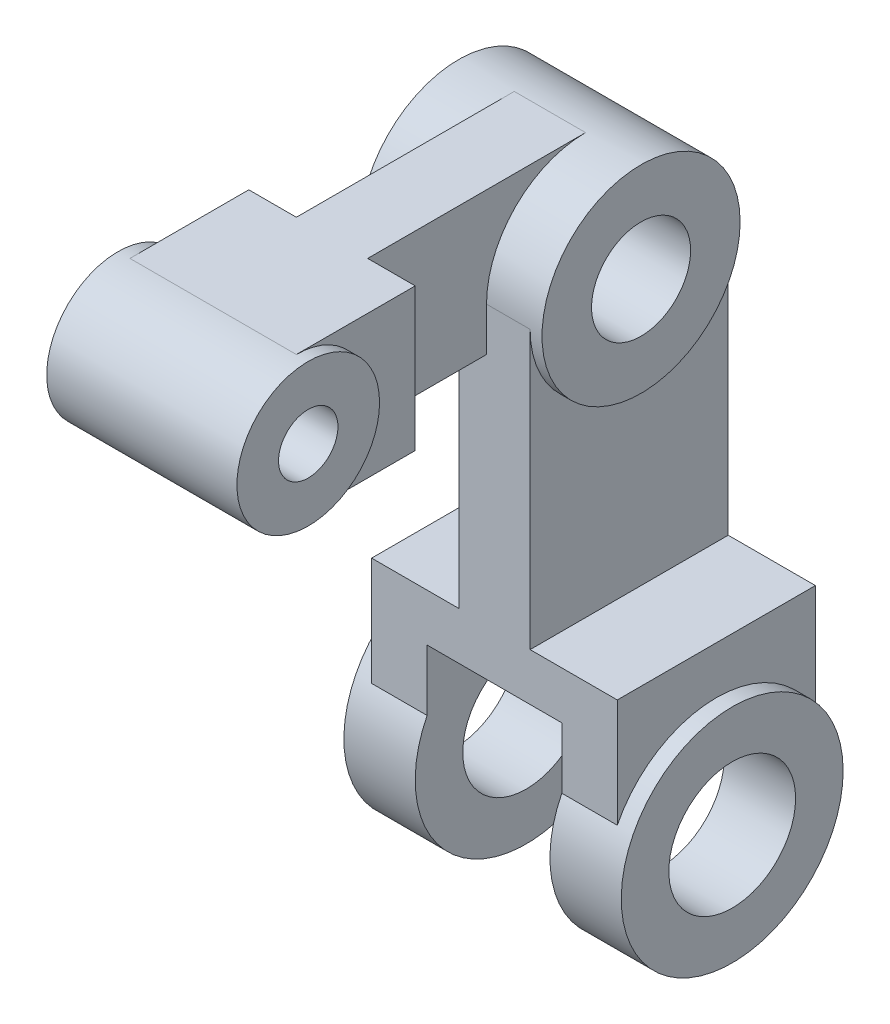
ISO-10303-21;
HEADER;
FILE_DESCRIPTION(('STEP AP214'),'2;1');
FILE_NAME('part.step','',(''),(''),'','','');
FILE_SCHEMA(('AUTOMOTIVE_DESIGN { 1 0 10303 214 1 1 1 1 }'));
ENDSEC;
DATA;
#1=APPLICATION_CONTEXT('core data for automotive mechanical design processes');
#2=APPLICATION_PROTOCOL_DEFINITION('international standard','automotive_design',2000,#1);
#3=PRODUCT_CONTEXT('',#1,'mechanical');
#4=PRODUCT('Part','Part','',(#3));
#5=PRODUCT_RELATED_PRODUCT_CATEGORY('part','',(#4));
#6=PRODUCT_DEFINITION_FORMATION('','',#4);
#7=PRODUCT_DEFINITION_CONTEXT('part definition',#1,'design');
#8=PRODUCT_DEFINITION('design','',#6,#7);
#9=PRODUCT_DEFINITION_SHAPE('','',#8);
#10=(LENGTH_UNIT() NAMED_UNIT(*) SI_UNIT(.MILLI.,.METRE.));
#11=(NAMED_UNIT(*) PLANE_ANGLE_UNIT() SI_UNIT($,.RADIAN.));
#12=(NAMED_UNIT(*) SI_UNIT($,.STERADIAN.) SOLID_ANGLE_UNIT());
#13=UNCERTAINTY_MEASURE_WITH_UNIT(LENGTH_MEASURE(1.E-05),#10,'distance_accuracy_value','');
#14=(GEOMETRIC_REPRESENTATION_CONTEXT(3) GLOBAL_UNCERTAINTY_ASSIGNED_CONTEXT((#13)) GLOBAL_UNIT_ASSIGNED_CONTEXT((#10,
#11,#12)) REPRESENTATION_CONTEXT('',''));
#15=CARTESIAN_POINT('',(0.,0.,0.));
#16=DIRECTION('',(0.,0.,1.));
#17=DIRECTION('',(1.,0.,0.));
#18=AXIS2_PLACEMENT_3D('',#15,#16,#17);
#19=CARTESIAN_POINT('',(35.,0.,0.));
#20=DIRECTION('',(-1.,0.,0.));
#21=DIRECTION('',(0.,0.,1.));
#22=AXIS2_PLACEMENT_3D('',#19,#20,#21);
#23=CYLINDRICAL_SURFACE('',#22,28.);
#24=CARTESIAN_POINT('',(35.,0.,0.));
#25=DIRECTION('',(1.,0.,0.));
#26=DIRECTION('',(0.,0.,-1.));
#27=AXIS2_PLACEMENT_3D('',#24,#25,#26);
#28=CIRCLE('',#27,28.);
#29=CARTESIAN_POINT('',(35.,0.,-28.));
#30=VERTEX_POINT('',#29);
#31=EDGE_CURVE('E386',#30,#30,#28,.T.);
#32=ORIENTED_EDGE('',*,*,#31,.F.);
#33=EDGE_LOOP('',(#32));
#34=FACE_BOUND('',#33,.T.);
#35=DIRECTION('',(-1.,0.,0.));
#36=VECTOR('',#35,1.);
#37=CARTESIAN_POINT('',(31.,12.6095202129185,25.));
#38=LINE('',#37,#36);
#39=CARTESIAN_POINT('',(31.,12.6095202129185,25.));
#40=VERTEX_POINT('',#39);
#41=CARTESIAN_POINT('',(17.,12.6095202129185,25.));
#42=VERTEX_POINT('',#41);
#43=EDGE_CURVE('E394',#40,#42,#38,.T.);
#44=ORIENTED_EDGE('',*,*,#43,.T.);
#45=CARTESIAN_POINT('',(17.,0.,0.));
#46=DIRECTION('',(1.,0.,0.));
#47=DIRECTION('',(0.,1.,0.));
#48=AXIS2_PLACEMENT_3D('',#45,#46,#47);
#49=CIRCLE('',#48,28.);
#50=CARTESIAN_POINT('',(17.,12.6095202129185,-25.));
#51=VERTEX_POINT('',#50);
#52=EDGE_CURVE('E281',#42,#51,#49,.T.);
#53=ORIENTED_EDGE('',*,*,#52,.T.);
#54=DIRECTION('',(-1.,0.,0.));
#55=VECTOR('',#54,1.);
#56=CARTESIAN_POINT('',(31.,12.6095202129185,-25.));
#57=LINE('',#56,#55);
#58=CARTESIAN_POINT('',(31.,12.6095202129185,-25.));
#59=VERTEX_POINT('',#58);
#60=EDGE_CURVE('E399',#59,#51,#57,.T.);
#61=ORIENTED_EDGE('',*,*,#60,.F.);
#62=CARTESIAN_POINT('',(31.,0.,0.));
#63=DIRECTION('',(-1.,0.,0.));
#64=DIRECTION('',(0.,0.,-1.));
#65=AXIS2_PLACEMENT_3D('',#62,#63,#64);
#66=CIRCLE('',#65,28.);
#67=EDGE_CURVE('E355',#40,#59,#66,.T.);
#68=ORIENTED_EDGE('',*,*,#67,.F.);
#69=EDGE_LOOP('',(#44,#53,#61,#68));
#70=FACE_BOUND('',#69,.T.);
#71=ADVANCED_FACE('F39',(#34,#70),#23,.T.);
#72=CARTESIAN_POINT('',(35.,0.,0.));
#73=DIRECTION('',(-1.,0.,0.));
#74=DIRECTION('',(0.,0.,1.));
#75=AXIS2_PLACEMENT_3D('',#72,#73,#74);
#76=CYLINDRICAL_SURFACE('',#75,16.);
#77=CARTESIAN_POINT('',(-17.,0.,0.));
#78=DIRECTION('',(-1.,0.,0.));
#79=DIRECTION('',(0.,-1.,0.));
#80=AXIS2_PLACEMENT_3D('',#77,#78,#79);
#81=CIRCLE('',#80,16.);
#82=CARTESIAN_POINT('',(-17.,-16.,0.));
#83=VERTEX_POINT('',#82);
#84=EDGE_CURVE('E300',#83,#83,#81,.T.);
#85=ORIENTED_EDGE('',*,*,#84,.F.);
#86=EDGE_LOOP('',(#85));
#87=FACE_BOUND('',#86,.T.);
#88=CARTESIAN_POINT('',(-35.,0.,0.));
#89=DIRECTION('',(1.,0.,0.));
#90=DIRECTION('',(0.,0.,-1.));
#91=AXIS2_PLACEMENT_3D('',#88,#89,#90);
#92=CIRCLE('',#91,16.);
#93=CARTESIAN_POINT('',(-35.,0.,-16.));
#94=VERTEX_POINT('',#93);
#95=EDGE_CURVE('E391',#94,#94,#92,.T.);
#96=ORIENTED_EDGE('',*,*,#95,.F.);
#97=EDGE_LOOP('',(#96));
#98=FACE_BOUND('',#97,.T.);
#99=ADVANCED_FACE('F489',(#87,#98),#76,.F.);
#100=CARTESIAN_POINT('',(31.,40.,25.));
#101=DIRECTION('',(0.,-1.,0.));
#102=DIRECTION('',(0.,0.,-1.));
#103=AXIS2_PLACEMENT_3D('',#100,#101,#102);
#104=PLANE('',#103);
#105=DIRECTION('',(0.,0.,-1.));
#106=VECTOR('',#105,1.);
#107=CARTESIAN_POINT('',(9.,40.,0.));
#108=LINE('',#107,#106);
#109=CARTESIAN_POINT('',(9.,40.,25.));
#110=VERTEX_POINT('',#109);
#111=CARTESIAN_POINT('',(9.,40.,-25.));
#112=VERTEX_POINT('',#111);
#113=EDGE_CURVE('E324',#110,#112,#108,.T.);
#114=ORIENTED_EDGE('',*,*,#113,.F.);
#115=DIRECTION('',(-1.,0.,0.));
#116=VECTOR('',#115,1.);
#117=CARTESIAN_POINT('',(31.,40.,25.));
#118=LINE('',#117,#116);
#119=CARTESIAN_POINT('',(31.,40.,25.));
#120=VERTEX_POINT('',#119);
#121=EDGE_CURVE('E380',#120,#110,#118,.T.);
#122=ORIENTED_EDGE('',*,*,#121,.F.);
#123=DIRECTION('',(0.,0.,1.));
#124=VECTOR('',#123,1.);
#125=CARTESIAN_POINT('',(31.,40.,25.));
#126=LINE('',#125,#124);
#127=CARTESIAN_POINT('',(31.,40.,-25.));
#128=VERTEX_POINT('',#127);
#129=EDGE_CURVE('E361',#128,#120,#126,.T.);
#130=ORIENTED_EDGE('',*,*,#129,.F.);
#131=DIRECTION('',(-1.,0.,0.));
#132=VECTOR('',#131,1.);
#133=CARTESIAN_POINT('',(31.,40.,-25.));
#134=LINE('',#133,#132);
#135=EDGE_CURVE('E405',#128,#112,#134,.T.);
#136=ORIENTED_EDGE('',*,*,#135,.T.);
#137=EDGE_LOOP('',(#114,#122,#130,#136));
#138=FACE_BOUND('',#137,.T.);
#139=ADVANCED_FACE('F462',(#138),#104,.F.);
#140=CARTESIAN_POINT('',(35.,0.,0.));
#141=DIRECTION('',(1.,0.,0.));
#142=DIRECTION('',(0.,0.,-1.));
#143=AXIS2_PLACEMENT_3D('',#140,#141,#142);
#144=PLANE('',#143);
#145=ORIENTED_EDGE('',*,*,#31,.T.);
#146=EDGE_LOOP('',(#145));
#147=FACE_BOUND('',#146,.T.);
#148=CARTESIAN_POINT('',(35.,0.,0.));
#149=DIRECTION('',(1.,0.,0.));
#150=DIRECTION('',(0.,0.,-1.));
#151=AXIS2_PLACEMENT_3D('',#148,#149,#150);
#152=CIRCLE('',#151,16.);
#153=CARTESIAN_POINT('',(35.,0.,-16.));
#154=VERTEX_POINT('',#153);
#155=EDGE_CURVE('E387',#154,#154,#152,.T.);
#156=ORIENTED_EDGE('',*,*,#155,.F.);
#157=EDGE_LOOP('',(#156));
#158=FACE_BOUND('',#157,.T.);
#159=ADVANCED_FACE('F486',(#147,#158),#144,.T.);
#160=CARTESIAN_POINT('',(-35.,0.,0.));
#161=DIRECTION('',(1.,0.,0.));
#162=DIRECTION('',(0.,0.,-1.));
#163=AXIS2_PLACEMENT_3D('',#160,#161,#162);
#164=PLANE('',#163);
#165=CARTESIAN_POINT('',(-35.,0.,0.));
#166=DIRECTION('',(1.,0.,0.));
#167=DIRECTION('',(0.,0.,-1.));
#168=AXIS2_PLACEMENT_3D('',#165,#166,#167);
#169=CIRCLE('',#168,28.);
#170=CARTESIAN_POINT('',(-35.,0.,-28.));
#171=VERTEX_POINT('',#170);
#172=EDGE_CURVE('E383',#171,#171,#169,.T.);
#173=ORIENTED_EDGE('',*,*,#172,.F.);
#174=EDGE_LOOP('',(#173));
#175=FACE_BOUND('',#174,.T.);
#176=ORIENTED_EDGE('',*,*,#95,.T.);
#177=EDGE_LOOP('',(#176));
#178=FACE_BOUND('',#177,.T.);
#179=ADVANCED_FACE('F481',(#175,#178),#164,.F.);
#180=CARTESIAN_POINT('',(-17.,12.6095202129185,-25.));
#181=VERTEX_POINT('',#180);
#182=CARTESIAN_POINT('',(-31.,12.6095202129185,-25.));
#183=VERTEX_POINT('',#182);
#184=EDGE_CURVE('E401',#181,#183,#57,.T.);
#185=ORIENTED_EDGE('',*,*,#184,.F.);
#186=CARTESIAN_POINT('',(-17.,0.,0.));
#187=DIRECTION('',(-1.,0.,0.));
#188=DIRECTION('',(0.,-1.,0.));
#189=AXIS2_PLACEMENT_3D('',#186,#187,#188);
#190=CIRCLE('',#189,28.);
#191=CARTESIAN_POINT('',(-17.,12.6095202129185,25.));
#192=VERTEX_POINT('',#191);
#193=EDGE_CURVE('E294',#181,#192,#190,.T.);
#194=ORIENTED_EDGE('',*,*,#193,.T.);
#195=CARTESIAN_POINT('',(-31.,12.6095202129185,25.));
#196=VERTEX_POINT('',#195);
#197=EDGE_CURVE('E398',#192,#196,#38,.T.);
#198=ORIENTED_EDGE('',*,*,#197,.T.);
#199=CARTESIAN_POINT('',(-31.,0.,0.));
#200=DIRECTION('',(-1.,0.,0.));
#201=DIRECTION('',(0.,0.,-1.));
#202=AXIS2_PLACEMENT_3D('',#199,#200,#201);
#203=CIRCLE('',#202,28.);
#204=EDGE_CURVE('E366',#196,#183,#203,.T.);
#205=ORIENTED_EDGE('',*,*,#204,.T.);
#206=EDGE_LOOP('',(#185,#194,#198,#205));
#207=FACE_BOUND('',#206,.T.);
#208=ORIENTED_EDGE('',*,*,#172,.T.);
#209=EDGE_LOOP('',(#208));
#210=FACE_BOUND('',#209,.T.);
#211=ADVANCED_FACE('F41',(#207,#210),#23,.T.);
#212=CARTESIAN_POINT('',(17.,0.,0.));
#213=DIRECTION('',(1.,0.,0.));
#214=DIRECTION('',(0.,1.,0.));
#215=AXIS2_PLACEMENT_3D('',#212,#213,#214);
#216=CIRCLE('',#215,16.);
#217=CARTESIAN_POINT('',(17.,16.,0.));
#218=VERTEX_POINT('',#217);
#219=EDGE_CURVE('E288',#218,#218,#216,.T.);
#220=ORIENTED_EDGE('',*,*,#219,.F.);
#221=EDGE_LOOP('',(#220));
#222=FACE_BOUND('',#221,.T.);
#223=ORIENTED_EDGE('',*,*,#155,.T.);
#224=EDGE_LOOP('',(#223));
#225=FACE_BOUND('',#224,.T.);
#226=ADVANCED_FACE('F480',(#222,#225),#76,.F.);
#227=CARTESIAN_POINT('',(31.,40.,25.));
#228=DIRECTION('',(0.,0.,-1.));
#229=DIRECTION('',(0.,1.,0.));
#230=AXIS2_PLACEMENT_3D('',#227,#228,#229);
#231=PLANE('',#230);
#232=DIRECTION('',(0.,1.,0.));
#233=VECTOR('',#232,1.);
#234=CARTESIAN_POINT('',(-2.,134.99999999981,24.9999999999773));
#235=LINE('',#234,#233);
#236=CARTESIAN_POINT('',(-2.,99.,25.));
#237=VERTEX_POINT('',#236);
#238=CARTESIAN_POINT('',(-2.,110.,25.));
#239=VERTEX_POINT('',#238);
#240=EDGE_CURVE('E56',#237,#239,#235,.T.);
#241=ORIENTED_EDGE('',*,*,#240,.F.);
#242=DIRECTION('',(1.,0.,0.));
#243=VECTOR('',#242,1.);
#244=CARTESIAN_POINT('',(-20.,99.,24.9999999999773));
#245=LINE('',#244,#243);
#246=CARTESIAN_POINT('',(-9.,99.,25.));
#247=VERTEX_POINT('',#246);
#248=EDGE_CURVE('E60',#247,#237,#245,.T.);
#249=ORIENTED_EDGE('',*,*,#248,.F.);
#250=DIRECTION('',(0.,1.,0.));
#251=VECTOR('',#250,1.);
#252=CARTESIAN_POINT('',(-9.,0.,25.));
#253=LINE('',#252,#251);
#254=CARTESIAN_POINT('',(-9.,40.,25.));
#255=VERTEX_POINT('',#254);
#256=EDGE_CURVE('E343',#255,#247,#253,.T.);
#257=ORIENTED_EDGE('',*,*,#256,.F.);
#258=CARTESIAN_POINT('',(-31.,40.,25.));
#259=VERTEX_POINT('',#258);
#260=EDGE_CURVE('E363',#255,#259,#118,.T.);
#261=ORIENTED_EDGE('',*,*,#260,.T.);
#262=DIRECTION('',(0.,-1.,0.));
#263=VECTOR('',#262,1.);
#264=CARTESIAN_POINT('',(-31.,40.,25.));
#265=LINE('',#264,#263);
#266=EDGE_CURVE('E351',#259,#196,#265,.T.);
#267=ORIENTED_EDGE('',*,*,#266,.T.);
#268=ORIENTED_EDGE('',*,*,#197,.F.);
#269=DIRECTION('',(0.,1.,0.));
#270=VECTOR('',#269,1.);
#271=CARTESIAN_POINT('',(-17.,40.,25.));
#272=LINE('',#271,#270);
#273=CARTESIAN_POINT('',(-17.,28.,25.));
#274=VERTEX_POINT('',#273);
#275=EDGE_CURVE('E297',#192,#274,#272,.T.);
#276=ORIENTED_EDGE('',*,*,#275,.T.);
#277=DIRECTION('',(1.,0.,0.));
#278=VECTOR('',#277,1.);
#279=CARTESIAN_POINT('',(31.,28.,25.));
#280=LINE('',#279,#278);
#281=CARTESIAN_POINT('',(17.,28.,25.));
#282=VERTEX_POINT('',#281);
#283=EDGE_CURVE('E291',#274,#282,#280,.T.);
#284=ORIENTED_EDGE('',*,*,#283,.T.);
#285=DIRECTION('',(0.,-1.,0.));
#286=VECTOR('',#285,1.);
#287=CARTESIAN_POINT('',(17.,40.,25.));
#288=LINE('',#287,#286);
#289=EDGE_CURVE('E285',#282,#42,#288,.T.);
#290=ORIENTED_EDGE('',*,*,#289,.T.);
#291=ORIENTED_EDGE('',*,*,#43,.F.);
#292=DIRECTION('',(0.,-1.,0.));
#293=VECTOR('',#292,1.);
#294=CARTESIAN_POINT('',(31.,40.,25.));
#295=LINE('',#294,#293);
#296=EDGE_CURVE('E352',#120,#40,#295,.T.);
#297=ORIENTED_EDGE('',*,*,#296,.F.);
#298=ORIENTED_EDGE('',*,*,#121,.T.);
#299=DIRECTION('',(0.,1.,0.));
#300=VECTOR('',#299,1.);
#301=CARTESIAN_POINT('',(9.,0.,25.));
#302=LINE('',#301,#300);
#303=CARTESIAN_POINT('',(9.,110.,25.));
#304=VERTEX_POINT('',#303);
#305=EDGE_CURVE('E318',#110,#304,#302,.T.);
#306=ORIENTED_EDGE('',*,*,#305,.T.);
#307=DIRECTION('',(-1.,0.,0.));
#308=VECTOR('',#307,1.);
#309=CARTESIAN_POINT('',(9.,110.,25.));
#310=LINE('',#309,#308);
#311=EDGE_CURVE('E349',#304,#239,#310,.T.);
#312=ORIENTED_EDGE('',*,*,#311,.T.);
#313=EDGE_LOOP('',(#241,#249,#257,#261,#267,#268,#276,#284,#290,#291,#297,#298,#306,#312));
#314=FACE_BOUND('',#313,.T.);
#315=ADVANCED_FACE('F425',(#314),#231,.F.);
#316=CARTESIAN_POINT('',(31.,40.,-25.));
#317=DIRECTION('',(0.,0.,1.));
#318=DIRECTION('',(0.,-1.,0.));
#319=AXIS2_PLACEMENT_3D('',#316,#317,#318);
#320=PLANE('',#319);
#321=DIRECTION('',(-1.,0.,0.));
#322=VECTOR('',#321,1.);
#323=CARTESIAN_POINT('',(31.,28.,-25.));
#324=LINE('',#323,#322);
#325=CARTESIAN_POINT('',(17.,28.,-25.));
#326=VERTEX_POINT('',#325);
#327=CARTESIAN_POINT('',(-17.,28.,-25.));
#328=VERTEX_POINT('',#327);
#329=EDGE_CURVE('E48',#326,#328,#324,.T.);
#330=ORIENTED_EDGE('',*,*,#329,.T.);
#331=DIRECTION('',(0.,-1.,0.));
#332=VECTOR('',#331,1.);
#333=CARTESIAN_POINT('',(-17.,40.,-25.));
#334=LINE('',#333,#332);
#335=EDGE_CURVE('E11',#328,#181,#334,.T.);
#336=ORIENTED_EDGE('',*,*,#335,.T.);
#337=ORIENTED_EDGE('',*,*,#184,.T.);
#338=DIRECTION('',(0.,1.,0.));
#339=VECTOR('',#338,1.);
#340=CARTESIAN_POINT('',(-31.,40.,-25.));
#341=LINE('',#340,#339);
#342=CARTESIAN_POINT('',(-31.,40.,-25.));
#343=VERTEX_POINT('',#342);
#344=EDGE_CURVE('E369',#183,#343,#341,.T.);
#345=ORIENTED_EDGE('',*,*,#344,.T.);
#346=CARTESIAN_POINT('',(-9.,40.,-25.));
#347=VERTEX_POINT('',#346);
#348=EDGE_CURVE('E329',#347,#343,#134,.T.);
#349=ORIENTED_EDGE('',*,*,#348,.F.);
#350=DIRECTION('',(0.,1.,0.));
#351=VECTOR('',#350,1.);
#352=CARTESIAN_POINT('',(-9.,0.,-25.));
#353=LINE('',#352,#351);
#354=CARTESIAN_POINT('',(-9.,110.,-25.));
#355=VERTEX_POINT('',#354);
#356=EDGE_CURVE('E319',#347,#355,#353,.T.);
#357=ORIENTED_EDGE('',*,*,#356,.T.);
#358=DIRECTION('',(-1.,0.,0.));
#359=VECTOR('',#358,1.);
#360=CARTESIAN_POINT('',(9.,110.,-25.));
#361=LINE('',#360,#359);
#362=CARTESIAN_POINT('',(9.,110.,-25.));
#363=VERTEX_POINT('',#362);
#364=EDGE_CURVE('E334',#363,#355,#361,.T.);
#365=ORIENTED_EDGE('',*,*,#364,.F.);
#366=DIRECTION('',(0.,1.,0.));
#367=VECTOR('',#366,1.);
#368=CARTESIAN_POINT('',(9.,0.,-25.));
#369=LINE('',#368,#367);
#370=EDGE_CURVE('E328',#112,#363,#369,.T.);
#371=ORIENTED_EDGE('',*,*,#370,.F.);
#372=ORIENTED_EDGE('',*,*,#135,.F.);
#373=DIRECTION('',(0.,1.,0.));
#374=VECTOR('',#373,1.);
#375=CARTESIAN_POINT('',(31.,40.,-25.));
#376=LINE('',#375,#374);
#377=EDGE_CURVE('E359',#59,#128,#376,.T.);
#378=ORIENTED_EDGE('',*,*,#377,.F.);
#379=ORIENTED_EDGE('',*,*,#60,.T.);
#380=DIRECTION('',(0.,1.,0.));
#381=VECTOR('',#380,1.);
#382=CARTESIAN_POINT('',(17.,40.,-25.));
#383=LINE('',#382,#381);
#384=EDGE_CURVE('E390',#51,#326,#383,.T.);
#385=ORIENTED_EDGE('',*,*,#384,.T.);
#386=EDGE_LOOP('',(#330,#336,#337,#345,#349,#357,#365,#371,#372,#378,#379,#385));
#387=FACE_BOUND('',#386,.T.);
#388=ADVANCED_FACE('F420',(#387),#320,.F.);
#389=ORIENTED_EDGE('',*,*,#260,.F.);
#390=DIRECTION('',(0.,0.,-1.));
#391=VECTOR('',#390,1.);
#392=CARTESIAN_POINT('',(-9.,40.,0.));
#393=LINE('',#392,#391);
#394=EDGE_CURVE('E341',#255,#347,#393,.T.);
#395=ORIENTED_EDGE('',*,*,#394,.T.);
#396=ORIENTED_EDGE('',*,*,#348,.T.);
#397=DIRECTION('',(0.,0.,1.));
#398=VECTOR('',#397,1.);
#399=CARTESIAN_POINT('',(-31.,40.,25.));
#400=LINE('',#399,#398);
#401=EDGE_CURVE('E356',#343,#259,#400,.T.);
#402=ORIENTED_EDGE('',*,*,#401,.T.);
#403=EDGE_LOOP('',(#389,#395,#396,#402));
#404=FACE_BOUND('',#403,.T.);
#405=ADVANCED_FACE('F412',(#404),#104,.F.);
#406=CARTESIAN_POINT('',(31.,0.,0.));
#407=DIRECTION('',(1.,0.,0.));
#408=DIRECTION('',(0.,0.,-1.));
#409=AXIS2_PLACEMENT_3D('',#406,#407,#408);
#410=PLANE('',#409);
#411=ORIENTED_EDGE('',*,*,#296,.T.);
#412=ORIENTED_EDGE('',*,*,#67,.T.);
#413=ORIENTED_EDGE('',*,*,#377,.T.);
#414=ORIENTED_EDGE('',*,*,#129,.T.);
#415=EDGE_LOOP('',(#411,#412,#413,#414));
#416=FACE_BOUND('',#415,.T.);
#417=ADVANCED_FACE('F466',(#416),#410,.T.);
#418=CARTESIAN_POINT('',(-31.,0.,0.));
#419=DIRECTION('',(1.,0.,0.));
#420=DIRECTION('',(0.,0.,-1.));
#421=AXIS2_PLACEMENT_3D('',#418,#419,#420);
#422=PLANE('',#421);
#423=ORIENTED_EDGE('',*,*,#266,.F.);
#424=ORIENTED_EDGE('',*,*,#401,.F.);
#425=ORIENTED_EDGE('',*,*,#344,.F.);
#426=ORIENTED_EDGE('',*,*,#204,.F.);
#427=EDGE_LOOP('',(#423,#424,#425,#426));
#428=FACE_BOUND('',#427,.T.);
#429=ADVANCED_FACE('F423',(#428),#422,.F.);
#430=CARTESIAN_POINT('',(9.,0.,0.));
#431=DIRECTION('',(1.,0.,0.));
#432=DIRECTION('',(0.,0.,-1.));
#433=AXIS2_PLACEMENT_3D('',#430,#431,#432);
#434=PLANE('',#433);
#435=CARTESIAN_POINT('',(9.,110.,0.));
#436=DIRECTION('',(1.,0.,0.));
#437=DIRECTION('',(0.,0.,-1.));
#438=AXIS2_PLACEMENT_3D('',#435,#436,#437);
#439=CIRCLE('',#438,25.);
#440=EDGE_CURVE('E316',#304,#363,#439,.T.);
#441=ORIENTED_EDGE('',*,*,#440,.F.);
#442=ORIENTED_EDGE('',*,*,#305,.F.);
#443=ORIENTED_EDGE('',*,*,#113,.T.);
#444=ORIENTED_EDGE('',*,*,#370,.T.);
#445=EDGE_LOOP('',(#441,#442,#443,#444));
#446=FACE_BOUND('',#445,.T.);
#447=ADVANCED_FACE('F459',(#446),#434,.T.);
#448=CARTESIAN_POINT('',(-9.,0.,0.));
#449=DIRECTION('',(1.,0.,0.));
#450=DIRECTION('',(0.,0.,-1.));
#451=AXIS2_PLACEMENT_3D('',#448,#449,#450);
#452=PLANE('',#451);
#453=ORIENTED_EDGE('',*,*,#256,.T.);
#454=DIRECTION('',(0.,0.,1.));
#455=VECTOR('',#454,1.);
#456=CARTESIAN_POINT('',(-9.,99.,-500000.));
#457=LINE('',#456,#455);
#458=CARTESIAN_POINT('',(-9.,99.,22.4499443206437));
#459=VERTEX_POINT('',#458);
#460=EDGE_CURVE('E270',#459,#247,#457,.T.);
#461=ORIENTED_EDGE('',*,*,#460,.F.);
#462=CARTESIAN_POINT('',(-9.,110.,0.));
#463=DIRECTION('',(1.,0.,0.));
#464=DIRECTION('',(0.,0.,-1.));
#465=AXIS2_PLACEMENT_3D('',#462,#463,#464);
#466=CIRCLE('',#465,25.);
#467=EDGE_CURVE('E315',#459,#355,#466,.T.);
#468=ORIENTED_EDGE('',*,*,#467,.T.);
#469=ORIENTED_EDGE('',*,*,#356,.F.);
#470=ORIENTED_EDGE('',*,*,#394,.F.);
#471=EDGE_LOOP('',(#453,#461,#468,#469,#470));
#472=FACE_BOUND('',#471,.T.);
#473=ADVANCED_FACE('F427',(#472),#452,.F.);
#474=CARTESIAN_POINT('',(-34.,110.,0.));
#475=DIRECTION('',(1.,0.,0.));
#476=DIRECTION('',(0.,0.,-1.));
#477=AXIS2_PLACEMENT_3D('',#474,#475,#476);
#478=CYLINDRICAL_SURFACE('',#477,12.5);
#479=CARTESIAN_POINT('',(-34.,110.,0.));
#480=DIRECTION('',(1.,0.,0.));
#481=DIRECTION('',(0.,0.,-1.));
#482=AXIS2_PLACEMENT_3D('',#479,#480,#481);
#483=CIRCLE('',#482,12.5);
#484=CARTESIAN_POINT('',(-34.,110.,-12.5));
#485=VERTEX_POINT('',#484);
#486=EDGE_CURVE('E309',#485,#485,#483,.T.);
#487=ORIENTED_EDGE('',*,*,#486,.F.);
#488=EDGE_LOOP('',(#487));
#489=FACE_BOUND('',#488,.T.);
#490=CARTESIAN_POINT('',(12.,110.,0.));
#491=DIRECTION('',(1.,0.,0.));
#492=DIRECTION('',(0.,0.,-1.));
#493=AXIS2_PLACEMENT_3D('',#490,#491,#492);
#494=CIRCLE('',#493,12.5);
#495=CARTESIAN_POINT('',(12.,110.,-12.5));
#496=VERTEX_POINT('',#495);
#497=EDGE_CURVE('E303',#496,#496,#494,.T.);
#498=ORIENTED_EDGE('',*,*,#497,.T.);
#499=EDGE_LOOP('',(#498));
#500=FACE_BOUND('',#499,.T.);
#501=ADVANCED_FACE('F593',(#489,#500),#478,.F.);
#502=CARTESIAN_POINT('',(-34.,110.,0.));
#503=DIRECTION('',(1.,0.,0.));
#504=DIRECTION('',(0.,0.,-1.));
#505=AXIS2_PLACEMENT_3D('',#502,#503,#504);
#506=CYLINDRICAL_SURFACE('',#505,25.);
#507=DIRECTION('',(1.,0.,0.));
#508=VECTOR('',#507,1.);
#509=CARTESIAN_POINT('',(-34.,99.,22.4499443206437));
#510=LINE('',#509,#508);
#511=CARTESIAN_POINT('',(-20.,99.0000000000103,22.4499443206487));
#512=VERTEX_POINT('',#511);
#513=EDGE_CURVE('E250',#459,#512,#510,.F.);
#514=ORIENTED_EDGE('',*,*,#513,.T.);
#515=CARTESIAN_POINT('',(-20.,110.,0.));
#516=DIRECTION('',(-1.,0.,0.));
#517=DIRECTION('',(0.,-1.,0.));
#518=AXIS2_PLACEMENT_3D('',#515,#516,#517);
#519=CIRCLE('',#518,25.);
#520=CARTESIAN_POINT('',(-20.,135.,0.));
#521=VERTEX_POINT('',#520);
#522=EDGE_CURVE('E272',#512,#521,#519,.T.);
#523=ORIENTED_EDGE('',*,*,#522,.T.);
#524=DIRECTION('',(1.,0.,0.));
#525=VECTOR('',#524,1.);
#526=CARTESIAN_POINT('',(-34.,135.,0.));
#527=LINE('',#526,#525);
#528=CARTESIAN_POINT('',(-2.,135.,0.));
#529=VERTEX_POINT('',#528);
#530=EDGE_CURVE('E207',#521,#529,#527,.T.);
#531=ORIENTED_EDGE('',*,*,#530,.T.);
#532=CARTESIAN_POINT('',(-1.99999999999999,110.,0.));
#533=DIRECTION('',(1.,0.,0.));
#534=DIRECTION('',(0.,1.,0.));
#535=AXIS2_PLACEMENT_3D('',#532,#533,#534);
#536=CIRCLE('',#535,25.);
#537=EDGE_CURVE('E275',#529,#239,#536,.T.);
#538=ORIENTED_EDGE('',*,*,#537,.T.);
#539=ORIENTED_EDGE('',*,*,#311,.F.);
#540=ORIENTED_EDGE('',*,*,#440,.T.);
#541=ORIENTED_EDGE('',*,*,#364,.T.);
#542=ORIENTED_EDGE('',*,*,#467,.F.);
#543=EDGE_LOOP('',(#514,#523,#531,#538,#539,#540,#541,#542));
#544=FACE_BOUND('',#543,.T.);
#545=CARTESIAN_POINT('',(-34.,110.,0.));
#546=DIRECTION('',(1.,0.,0.));
#547=DIRECTION('',(0.,0.,-1.));
#548=AXIS2_PLACEMENT_3D('',#545,#546,#547);
#549=CIRCLE('',#548,25.);
#550=CARTESIAN_POINT('',(-34.,110.,-25.));
#551=VERTEX_POINT('',#550);
#552=EDGE_CURVE('E312',#551,#551,#549,.T.);
#553=ORIENTED_EDGE('',*,*,#552,.T.);
#554=EDGE_LOOP('',(#553));
#555=FACE_BOUND('',#554,.T.);
#556=CARTESIAN_POINT('',(12.,110.,0.));
#557=DIRECTION('',(1.,0.,0.));
#558=DIRECTION('',(0.,0.,-1.));
#559=AXIS2_PLACEMENT_3D('',#556,#557,#558);
#560=CIRCLE('',#559,25.);
#561=CARTESIAN_POINT('',(12.,110.,-25.));
#562=VERTEX_POINT('',#561);
#563=EDGE_CURVE('E306',#562,#562,#560,.T.);
#564=ORIENTED_EDGE('',*,*,#563,.F.);
#565=EDGE_LOOP('',(#564));
#566=FACE_BOUND('',#565,.T.);
#567=ADVANCED_FACE('F454',(#544,#555,#566),#506,.T.);
#568=CARTESIAN_POINT('',(-34.,0.,0.));
#569=DIRECTION('',(1.,0.,0.));
#570=DIRECTION('',(0.,0.,-1.));
#571=AXIS2_PLACEMENT_3D('',#568,#569,#570);
#572=PLANE('',#571);
#573=ORIENTED_EDGE('',*,*,#486,.T.);
#574=EDGE_LOOP('',(#573));
#575=FACE_BOUND('',#574,.T.);
#576=ORIENTED_EDGE('',*,*,#552,.F.);
#577=EDGE_LOOP('',(#576));
#578=FACE_BOUND('',#577,.T.);
#579=ADVANCED_FACE('F605',(#575,#578),#572,.F.);
#580=CARTESIAN_POINT('',(12.,0.,0.));
#581=DIRECTION('',(1.,0.,0.));
#582=DIRECTION('',(0.,0.,-1.));
#583=AXIS2_PLACEMENT_3D('',#580,#581,#582);
#584=PLANE('',#583);
#585=ORIENTED_EDGE('',*,*,#497,.F.);
#586=EDGE_LOOP('',(#585));
#587=FACE_BOUND('',#586,.T.);
#588=ORIENTED_EDGE('',*,*,#563,.T.);
#589=EDGE_LOOP('',(#588));
#590=FACE_BOUND('',#589,.T.);
#591=ADVANCED_FACE('F556',(#587,#590),#584,.T.);
#592=CARTESIAN_POINT('',(-17.,28.,-28.));
#593=DIRECTION('',(-1.,0.,0.));
#594=DIRECTION('',(0.,-1.,0.));
#595=AXIS2_PLACEMENT_3D('',#592,#593,#594);
#596=PLANE('',#595);
#597=ORIENTED_EDGE('',*,*,#84,.T.);
#598=EDGE_LOOP('',(#597));
#599=FACE_BOUND('',#598,.T.);
#600=ORIENTED_EDGE('',*,*,#193,.F.);
#601=ORIENTED_EDGE('',*,*,#335,.F.);
#602=DIRECTION('',(0.,0.,1.));
#603=VECTOR('',#602,1.);
#604=CARTESIAN_POINT('',(-17.,28.,-28.));
#605=LINE('',#604,#603);
#606=EDGE_CURVE('E278',#328,#274,#605,.T.);
#607=ORIENTED_EDGE('',*,*,#606,.T.);
#608=ORIENTED_EDGE('',*,*,#275,.F.);
#609=EDGE_LOOP('',(#600,#601,#607,#608));
#610=FACE_BOUND('',#609,.T.);
#611=ADVANCED_FACE('F476',(#599,#610),#596,.F.);
#612=CARTESIAN_POINT('',(-17.,28.,-28.));
#613=DIRECTION('',(0.,1.,0.));
#614=DIRECTION('',(-1.,0.,0.));
#615=AXIS2_PLACEMENT_3D('',#612,#613,#614);
#616=PLANE('',#615);
#617=ORIENTED_EDGE('',*,*,#606,.F.);
#618=ORIENTED_EDGE('',*,*,#329,.F.);
#619=DIRECTION('',(0.,0.,1.));
#620=VECTOR('',#619,1.);
#621=CARTESIAN_POINT('',(17.,28.,-28.));
#622=LINE('',#621,#620);
#623=EDGE_CURVE('E264',#326,#282,#622,.T.);
#624=ORIENTED_EDGE('',*,*,#623,.T.);
#625=ORIENTED_EDGE('',*,*,#283,.F.);
#626=EDGE_LOOP('',(#617,#618,#624,#625));
#627=FACE_BOUND('',#626,.T.);
#628=ADVANCED_FACE('F474',(#627),#616,.F.);
#629=CARTESIAN_POINT('',(17.,28.,-28.));
#630=DIRECTION('',(1.,0.,0.));
#631=DIRECTION('',(0.,1.,0.));
#632=AXIS2_PLACEMENT_3D('',#629,#630,#631);
#633=PLANE('',#632);
#634=ORIENTED_EDGE('',*,*,#219,.T.);
#635=EDGE_LOOP('',(#634));
#636=FACE_BOUND('',#635,.T.);
#637=ORIENTED_EDGE('',*,*,#623,.F.);
#638=ORIENTED_EDGE('',*,*,#384,.F.);
#639=ORIENTED_EDGE('',*,*,#52,.F.);
#640=ORIENTED_EDGE('',*,*,#289,.F.);
#641=EDGE_LOOP('',(#637,#638,#639,#640));
#642=FACE_BOUND('',#641,.T.);
#643=ADVANCED_FACE('F470',(#636,#642),#633,.F.);
#644=CARTESIAN_POINT('',(-20.,99.,-500000.));
#645=DIRECTION('',(0.,-1.,0.));
#646=DIRECTION('',(0.,0.,-1.));
#647=AXIS2_PLACEMENT_3D('',#644,#645,#646);
#648=PLANE('',#647);
#649=ORIENTED_EDGE('',*,*,#513,.F.);
#650=ORIENTED_EDGE('',*,*,#460,.T.);
#651=ORIENTED_EDGE('',*,*,#248,.T.);
#652=DIRECTION('',(0.,0.,1.));
#653=VECTOR('',#652,1.);
#654=CARTESIAN_POINT('',(-2.,99.,-500000.));
#655=LINE('',#654,#653);
#656=CARTESIAN_POINT('',(-2.,99.,55.));
#657=VERTEX_POINT('',#656);
#658=EDGE_CURVE('E253',#237,#657,#655,.T.);
#659=ORIENTED_EDGE('',*,*,#658,.T.);
#660=DIRECTION('',(-1.,0.,0.));
#661=VECTOR('',#660,1.);
#662=CARTESIAN_POINT('',(10.,99.,55.));
#663=LINE('',#662,#661);
#664=CARTESIAN_POINT('',(10.,99.,55.));
#665=VERTEX_POINT('',#664);
#666=EDGE_CURVE('E208',#665,#657,#663,.T.);
#667=ORIENTED_EDGE('',*,*,#666,.F.);
#668=DIRECTION('',(0.,0.,1.));
#669=VECTOR('',#668,1.);
#670=CARTESIAN_POINT('',(10.,99.,0.));
#671=LINE('',#670,#669);
#672=CARTESIAN_POINT('',(10.,99.,85.));
#673=VERTEX_POINT('',#672);
#674=EDGE_CURVE('E206',#665,#673,#671,.T.);
#675=ORIENTED_EDGE('',*,*,#674,.T.);
#676=DIRECTION('',(-1.,0.,0.));
#677=VECTOR('',#676,1.);
#678=CARTESIAN_POINT('',(10.,99.,85.));
#679=LINE('',#678,#677);
#680=CARTESIAN_POINT('',(-32.,99.,85.));
#681=VERTEX_POINT('',#680);
#682=EDGE_CURVE('E187',#673,#681,#679,.T.);
#683=ORIENTED_EDGE('',*,*,#682,.T.);
#684=DIRECTION('',(0.,0.,1.));
#685=VECTOR('',#684,1.);
#686=CARTESIAN_POINT('',(-32.,99.,0.));
#687=LINE('',#686,#685);
#688=CARTESIAN_POINT('',(-32.,99.,55.));
#689=VERTEX_POINT('',#688);
#690=EDGE_CURVE('E195',#689,#681,#687,.T.);
#691=ORIENTED_EDGE('',*,*,#690,.F.);
#692=CARTESIAN_POINT('',(-20.,99.,55.));
#693=VERTEX_POINT('',#692);
#694=EDGE_CURVE('E232',#693,#689,#663,.T.);
#695=ORIENTED_EDGE('',*,*,#694,.F.);
#696=DIRECTION('',(0.,0.,1.));
#697=VECTOR('',#696,1.);
#698=CARTESIAN_POINT('',(-20.,99.,-500000.));
#699=LINE('',#698,#697);
#700=EDGE_CURVE('E248',#512,#693,#699,.T.);
#701=ORIENTED_EDGE('',*,*,#700,.F.);
#702=EDGE_LOOP('',(#649,#650,#651,#659,#667,#675,#683,#691,#695,#701));
#703=FACE_BOUND('',#702,.T.);
#704=ADVANCED_FACE('F202',(#703),#648,.T.);
#705=CARTESIAN_POINT('',(-2.,135.,-500000.));
#706=DIRECTION('',(1.,0.,0.));
#707=DIRECTION('',(0.,1.,0.));
#708=AXIS2_PLACEMENT_3D('',#705,#706,#707);
#709=PLANE('',#708);
#710=ORIENTED_EDGE('',*,*,#537,.F.);
#711=DIRECTION('',(0.,0.,1.));
#712=VECTOR('',#711,1.);
#713=CARTESIAN_POINT('',(-2.,135.,-500000.));
#714=LINE('',#713,#712);
#715=CARTESIAN_POINT('',(-1.99999999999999,135.,55.));
#716=VERTEX_POINT('',#715);
#717=EDGE_CURVE('E255',#529,#716,#714,.T.);
#718=ORIENTED_EDGE('',*,*,#717,.T.);
#719=DIRECTION('',(0.,1.,0.));
#720=VECTOR('',#719,1.);
#721=CARTESIAN_POINT('',(-2.,135.,55.));
#722=LINE('',#721,#720);
#723=EDGE_CURVE('E265',#657,#716,#722,.T.);
#724=ORIENTED_EDGE('',*,*,#723,.F.);
#725=ORIENTED_EDGE('',*,*,#658,.F.);
#726=ORIENTED_EDGE('',*,*,#240,.T.);
#727=EDGE_LOOP('',(#710,#718,#724,#725,#726));
#728=FACE_BOUND('',#727,.T.);
#729=ADVANCED_FACE('F444',(#728),#709,.T.);
#730=CARTESIAN_POINT('',(-20.,135.,-500000.));
#731=DIRECTION('',(-1.,0.,0.));
#732=DIRECTION('',(0.,-1.,0.));
#733=AXIS2_PLACEMENT_3D('',#730,#731,#732);
#734=PLANE('',#733);
#735=ORIENTED_EDGE('',*,*,#522,.F.);
#736=ORIENTED_EDGE('',*,*,#700,.T.);
#737=DIRECTION('',(0.,-1.,0.));
#738=VECTOR('',#737,1.);
#739=CARTESIAN_POINT('',(-20.,135.,55.));
#740=LINE('',#739,#738);
#741=CARTESIAN_POINT('',(-20.,135.,55.));
#742=VERTEX_POINT('',#741);
#743=EDGE_CURVE('E246',#742,#693,#740,.T.);
#744=ORIENTED_EDGE('',*,*,#743,.F.);
#745=DIRECTION('',(0.,0.,1.));
#746=VECTOR('',#745,1.);
#747=CARTESIAN_POINT('',(-20.,135.,-500000.));
#748=LINE('',#747,#746);
#749=EDGE_CURVE('E241',#521,#742,#748,.T.);
#750=ORIENTED_EDGE('',*,*,#749,.F.);
#751=EDGE_LOOP('',(#735,#736,#744,#750));
#752=FACE_BOUND('',#751,.T.);
#753=ADVANCED_FACE('F616',(#752),#734,.T.);
#754=CARTESIAN_POINT('',(-20.,135.,-500000.));
#755=DIRECTION('',(0.,1.,0.));
#756=DIRECTION('',(0.,0.,1.));
#757=AXIS2_PLACEMENT_3D('',#754,#755,#756);
#758=PLANE('',#757);
#759=ORIENTED_EDGE('',*,*,#530,.F.);
#760=ORIENTED_EDGE('',*,*,#749,.T.);
#761=DIRECTION('',(-1.,0.,0.));
#762=VECTOR('',#761,1.);
#763=CARTESIAN_POINT('',(10.,135.,55.));
#764=LINE('',#763,#762);
#765=CARTESIAN_POINT('',(-32.,135.,55.));
#766=VERTEX_POINT('',#765);
#767=EDGE_CURVE('E221',#742,#766,#764,.T.);
#768=ORIENTED_EDGE('',*,*,#767,.T.);
#769=DIRECTION('',(0.,0.,-1.));
#770=VECTOR('',#769,1.);
#771=CARTESIAN_POINT('',(-32.,135.,0.));
#772=LINE('',#771,#770);
#773=CARTESIAN_POINT('',(-32.,135.,85.));
#774=VERTEX_POINT('',#773);
#775=EDGE_CURVE('E214',#774,#766,#772,.T.);
#776=ORIENTED_EDGE('',*,*,#775,.F.);
#777=DIRECTION('',(-1.,0.,0.));
#778=VECTOR('',#777,1.);
#779=CARTESIAN_POINT('',(10.,135.,85.));
#780=LINE('',#779,#778);
#781=CARTESIAN_POINT('',(10.,135.,85.));
#782=VERTEX_POINT('',#781);
#783=EDGE_CURVE('E190',#782,#774,#780,.T.);
#784=ORIENTED_EDGE('',*,*,#783,.F.);
#785=DIRECTION('',(0.,0.,-1.));
#786=VECTOR('',#785,1.);
#787=CARTESIAN_POINT('',(10.,135.,0.));
#788=LINE('',#787,#786);
#789=CARTESIAN_POINT('',(10.,135.,55.));
#790=VERTEX_POINT('',#789);
#791=EDGE_CURVE('E222',#782,#790,#788,.T.);
#792=ORIENTED_EDGE('',*,*,#791,.T.);
#793=EDGE_CURVE('E230',#790,#716,#764,.T.);
#794=ORIENTED_EDGE('',*,*,#793,.T.);
#795=ORIENTED_EDGE('',*,*,#717,.F.);
#796=EDGE_LOOP('',(#759,#760,#768,#776,#784,#792,#794,#795));
#797=FACE_BOUND('',#796,.T.);
#798=ADVANCED_FACE('F239',(#797),#758,.T.);
#799=CARTESIAN_POINT('',(10.,0.,55.));
#800=DIRECTION('',(0.,0.,-1.));
#801=DIRECTION('',(-1.,0.,0.));
#802=AXIS2_PLACEMENT_3D('',#799,#800,#801);
#803=PLANE('',#802);
#804=ORIENTED_EDGE('',*,*,#767,.F.);
#805=ORIENTED_EDGE('',*,*,#743,.T.);
#806=ORIENTED_EDGE('',*,*,#694,.T.);
#807=DIRECTION('',(0.,-1.,0.));
#808=VECTOR('',#807,1.);
#809=CARTESIAN_POINT('',(-32.,0.,55.));
#810=LINE('',#809,#808);
#811=EDGE_CURVE('E212',#766,#689,#810,.T.);
#812=ORIENTED_EDGE('',*,*,#811,.F.);
#813=EDGE_LOOP('',(#804,#805,#806,#812));
#814=FACE_BOUND('',#813,.T.);
#815=ADVANCED_FACE('F245',(#814),#803,.T.);
#816=ORIENTED_EDGE('',*,*,#666,.T.);
#817=ORIENTED_EDGE('',*,*,#723,.T.);
#818=ORIENTED_EDGE('',*,*,#793,.F.);
#819=DIRECTION('',(0.,-1.,0.));
#820=VECTOR('',#819,1.);
#821=CARTESIAN_POINT('',(10.,0.,55.));
#822=LINE('',#821,#820);
#823=EDGE_CURVE('E451',#790,#665,#822,.T.);
#824=ORIENTED_EDGE('',*,*,#823,.T.);
#825=EDGE_LOOP('',(#816,#817,#818,#824));
#826=FACE_BOUND('',#825,.T.);
#827=ADVANCED_FACE('F448',(#826),#803,.T.);
#828=CARTESIAN_POINT('',(10.,0.,0.));
#829=DIRECTION('',(1.,0.,0.));
#830=DIRECTION('',(0.,0.,-1.));
#831=AXIS2_PLACEMENT_3D('',#828,#829,#830);
#832=PLANE('',#831);
#833=CARTESIAN_POINT('',(10.,117.,85.));
#834=DIRECTION('',(1.,0.,0.));
#835=DIRECTION('',(0.,0.,-1.));
#836=AXIS2_PLACEMENT_3D('',#833,#834,#835);
#837=CIRCLE('',#836,18.);
#838=EDGE_CURVE('E219',#673,#782,#837,.T.);
#839=ORIENTED_EDGE('',*,*,#838,.F.);
#840=ORIENTED_EDGE('',*,*,#674,.F.);
#841=ORIENTED_EDGE('',*,*,#823,.F.);
#842=ORIENTED_EDGE('',*,*,#791,.F.);
#843=EDGE_LOOP('',(#839,#840,#841,#842));
#844=FACE_BOUND('',#843,.T.);
#845=ADVANCED_FACE('F644',(#844),#832,.T.);
#846=CARTESIAN_POINT('',(-32.,0.,0.));
#847=DIRECTION('',(1.,0.,0.));
#848=DIRECTION('',(0.,0.,-1.));
#849=AXIS2_PLACEMENT_3D('',#846,#847,#848);
#850=PLANE('',#849);
#851=CARTESIAN_POINT('',(-32.,117.,85.));
#852=DIRECTION('',(1.,0.,0.));
#853=DIRECTION('',(0.,0.,-1.));
#854=AXIS2_PLACEMENT_3D('',#851,#852,#853);
#855=CIRCLE('',#854,18.);
#856=EDGE_CURVE('E183',#681,#774,#855,.T.);
#857=ORIENTED_EDGE('',*,*,#856,.T.);
#858=ORIENTED_EDGE('',*,*,#775,.T.);
#859=ORIENTED_EDGE('',*,*,#811,.T.);
#860=ORIENTED_EDGE('',*,*,#690,.T.);
#861=EDGE_LOOP('',(#857,#858,#859,#860));
#862=FACE_BOUND('',#861,.T.);
#863=ADVANCED_FACE('F210',(#862),#850,.F.);
#864=CARTESIAN_POINT('',(13.,117.,85.));
#865=DIRECTION('',(-1.,0.,0.));
#866=DIRECTION('',(0.,0.,1.));
#867=AXIS2_PLACEMENT_3D('',#864,#865,#866);
#868=CYLINDRICAL_SURFACE('',#867,7.5);
#869=CARTESIAN_POINT('',(13.,117.,85.));
#870=DIRECTION('',(1.,0.,0.));
#871=DIRECTION('',(0.,0.,-1.));
#872=AXIS2_PLACEMENT_3D('',#869,#870,#871);
#873=CIRCLE('',#872,7.5);
#874=CARTESIAN_POINT('',(13.,117.,77.5));
#875=VERTEX_POINT('',#874);
#876=EDGE_CURVE('E793',#875,#875,#873,.T.);
#877=ORIENTED_EDGE('',*,*,#876,.T.);
#878=EDGE_LOOP('',(#877));
#879=FACE_BOUND('',#878,.T.);
#880=CARTESIAN_POINT('',(-35.,117.,85.));
#881=DIRECTION('',(1.,0.,0.));
#882=DIRECTION('',(0.,0.,-1.));
#883=AXIS2_PLACEMENT_3D('',#880,#881,#882);
#884=CIRCLE('',#883,7.5);
#885=CARTESIAN_POINT('',(-35.,117.,77.5));
#886=VERTEX_POINT('',#885);
#887=EDGE_CURVE('E788',#886,#886,#884,.T.);
#888=ORIENTED_EDGE('',*,*,#887,.F.);
#889=EDGE_LOOP('',(#888));
#890=FACE_BOUND('',#889,.T.);
#891=ADVANCED_FACE('F674',(#879,#890),#868,.F.);
#892=CARTESIAN_POINT('',(13.,117.,85.));
#893=DIRECTION('',(-1.,0.,0.));
#894=DIRECTION('',(0.,0.,1.));
#895=AXIS2_PLACEMENT_3D('',#892,#893,#894);
#896=CYLINDRICAL_SURFACE('',#895,18.);
#897=ORIENTED_EDGE('',*,*,#838,.T.);
#898=ORIENTED_EDGE('',*,*,#783,.T.);
#899=ORIENTED_EDGE('',*,*,#856,.F.);
#900=ORIENTED_EDGE('',*,*,#682,.F.);
#901=EDGE_LOOP('',(#897,#898,#899,#900));
#902=FACE_BOUND('',#901,.T.);
#903=CARTESIAN_POINT('',(13.,117.,85.));
#904=DIRECTION('',(1.,0.,0.));
#905=DIRECTION('',(0.,0.,-1.));
#906=AXIS2_PLACEMENT_3D('',#903,#904,#905);
#907=CIRCLE('',#906,18.);
#908=CARTESIAN_POINT('',(13.,117.,67.));
#909=VERTEX_POINT('',#908);
#910=EDGE_CURVE('E196',#909,#909,#907,.T.);
#911=ORIENTED_EDGE('',*,*,#910,.F.);
#912=EDGE_LOOP('',(#911));
#913=FACE_BOUND('',#912,.T.);
#914=CARTESIAN_POINT('',(-35.,117.,85.));
#915=DIRECTION('',(1.,0.,0.));
#916=DIRECTION('',(0.,0.,-1.));
#917=AXIS2_PLACEMENT_3D('',#914,#915,#916);
#918=CIRCLE('',#917,18.);
#919=CARTESIAN_POINT('',(-35.,117.,67.));
#920=VERTEX_POINT('',#919);
#921=EDGE_CURVE('E791',#920,#920,#918,.T.);
#922=ORIENTED_EDGE('',*,*,#921,.T.);
#923=EDGE_LOOP('',(#922));
#924=FACE_BOUND('',#923,.T.);
#925=ADVANCED_FACE('F185',(#902,#913,#924),#896,.T.);
#926=CARTESIAN_POINT('',(13.,0.,0.));
#927=DIRECTION('',(1.,0.,0.));
#928=DIRECTION('',(0.,0.,-1.));
#929=AXIS2_PLACEMENT_3D('',#926,#927,#928);
#930=PLANE('',#929);
#931=ORIENTED_EDGE('',*,*,#876,.F.);
#932=EDGE_LOOP('',(#931));
#933=FACE_BOUND('',#932,.T.);
#934=ORIENTED_EDGE('',*,*,#910,.T.);
#935=EDGE_LOOP('',(#934));
#936=FACE_BOUND('',#935,.T.);
#937=ADVANCED_FACE('F692',(#933,#936),#930,.T.);
#938=CARTESIAN_POINT('',(-35.,0.,0.));
#939=DIRECTION('',(1.,0.,0.));
#940=DIRECTION('',(0.,0.,-1.));
#941=AXIS2_PLACEMENT_3D('',#938,#939,#940);
#942=PLANE('',#941);
#943=ORIENTED_EDGE('',*,*,#887,.T.);
#944=EDGE_LOOP('',(#943));
#945=FACE_BOUND('',#944,.T.);
#946=ORIENTED_EDGE('',*,*,#921,.F.);
#947=EDGE_LOOP('',(#946));
#948=FACE_BOUND('',#947,.T.);
#949=ADVANCED_FACE('F701',(#945,#948),#942,.F.);
#950=CLOSED_SHELL('',(#71,#99,#139,#159,#179,#211,#226,#315,#388,#405,#417,#429,#447,#473,#501,
#567,#579,#591,#611,#628,#643,#704,#729,#753,#798,#815,#827,#845,#863,#891,#925,#937,#949));
#951=MANIFOLD_SOLID_BREP('B2',#950);
#952=ADVANCED_BREP_SHAPE_REPRESENTATION('',(#18,#951),#14);
#953=SHAPE_DEFINITION_REPRESENTATION(#9,#952);
ENDSEC;
END-ISO-10303-21;
